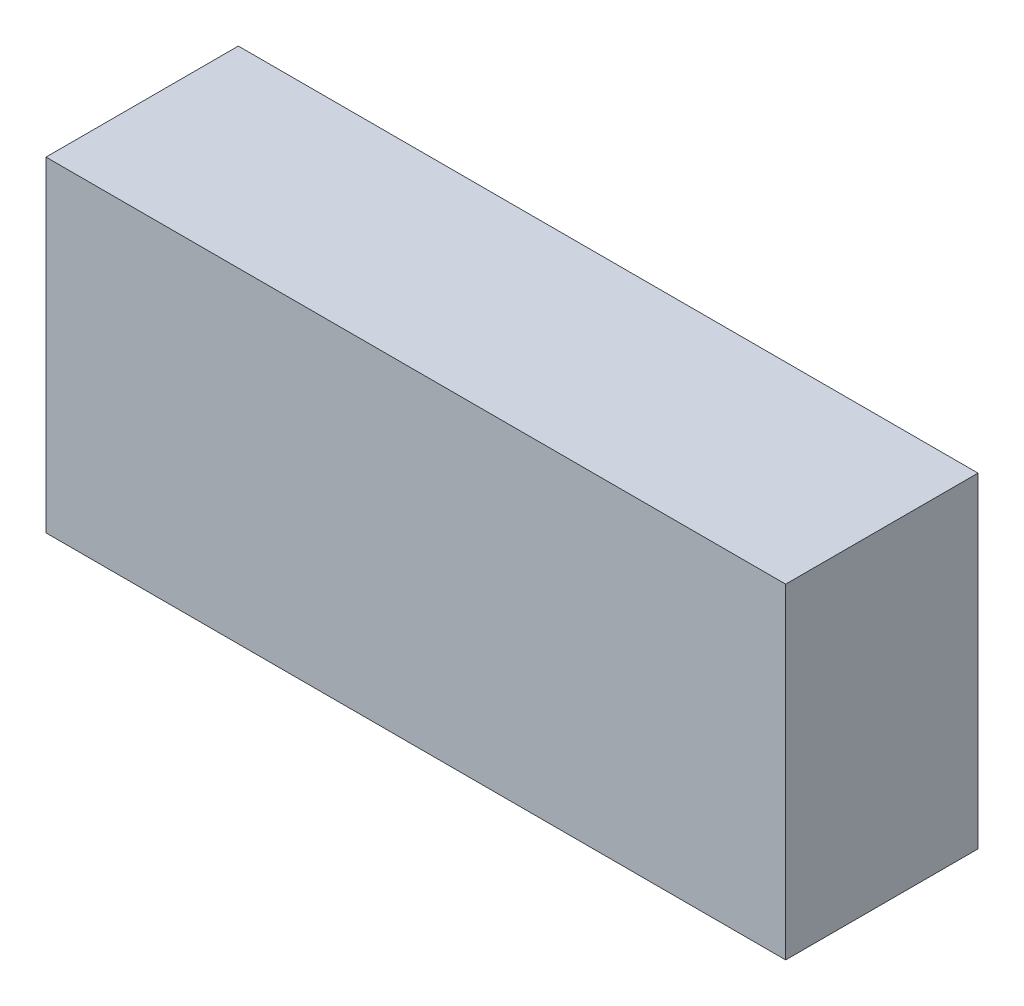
ISO-10303-21;
HEADER;
FILE_DESCRIPTION(('STEP AP214'),'2;1');
FILE_NAME('part.step','',(''),(''),'','','');
FILE_SCHEMA(('AUTOMOTIVE_DESIGN { 1 0 10303 214 1 1 1 1 }'));
ENDSEC;
DATA;
#1=APPLICATION_CONTEXT('core data for automotive mechanical design processes');
#2=APPLICATION_PROTOCOL_DEFINITION('international standard','automotive_design',2000,#1);
#3=PRODUCT_CONTEXT('',#1,'mechanical');
#4=PRODUCT('Part','Part','',(#3));
#5=PRODUCT_RELATED_PRODUCT_CATEGORY('part','',(#4));
#6=PRODUCT_DEFINITION_FORMATION('','',#4);
#7=PRODUCT_DEFINITION_CONTEXT('part definition',#1,'design');
#8=PRODUCT_DEFINITION('design','',#6,#7);
#9=PRODUCT_DEFINITION_SHAPE('','',#8);
#10=(LENGTH_UNIT() NAMED_UNIT(*) SI_UNIT(.MILLI.,.METRE.));
#11=(NAMED_UNIT(*) PLANE_ANGLE_UNIT() SI_UNIT($,.RADIAN.));
#12=(NAMED_UNIT(*) SI_UNIT($,.STERADIAN.) SOLID_ANGLE_UNIT());
#13=UNCERTAINTY_MEASURE_WITH_UNIT(LENGTH_MEASURE(1.E-05),#10,'distance_accuracy_value','');
#14=(GEOMETRIC_REPRESENTATION_CONTEXT(3) GLOBAL_UNCERTAINTY_ASSIGNED_CONTEXT((#13)) GLOBAL_UNIT_ASSIGNED_CONTEXT((#10,
#11,#12)) REPRESENTATION_CONTEXT('',''));
#15=CARTESIAN_POINT('',(0.,0.,0.));
#16=DIRECTION('',(0.,0.,1.));
#17=DIRECTION('',(1.,0.,0.));
#18=AXIS2_PLACEMENT_3D('',#15,#16,#17);
#19=CARTESIAN_POINT('',(-1.24999999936,0.54999999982,0.65000000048));
#20=DIRECTION('',(1.,0.,0.));
#21=DIRECTION('',(0.,0.,-1.));
#22=AXIS2_PLACEMENT_3D('',#19,#20,#21);
#23=PLANE('',#22);
#24=DIRECTION('',(0.,-1.,0.));
#25=VECTOR('',#24,1.);
#26=CARTESIAN_POINT('',(-1.24999999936,0.54999999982,0.));
#27=LINE('',#26,#25);
#28=CARTESIAN_POINT('',(-1.24999999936,0.54999999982,0.));
#29=VERTEX_POINT('',#28);
#30=CARTESIAN_POINT('',(-1.24999999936,-0.54999999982,0.));
#31=VERTEX_POINT('',#30);
#32=EDGE_CURVE('E96',#29,#31,#27,.T.);
#33=ORIENTED_EDGE('',*,*,#32,.T.);
#34=DIRECTION('',(0.,0.,-1.));
#35=VECTOR('',#34,1.);
#36=CARTESIAN_POINT('',(-1.24999999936,-0.54999999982,0.65000000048));
#37=LINE('',#36,#35);
#38=CARTESIAN_POINT('',(-1.24999999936,-0.54999999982,0.65000000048));
#39=VERTEX_POINT('',#38);
#40=EDGE_CURVE('E11',#39,#31,#37,.T.);
#41=ORIENTED_EDGE('',*,*,#40,.F.);
#42=DIRECTION('',(0.,-1.,0.));
#43=VECTOR('',#42,1.);
#44=CARTESIAN_POINT('',(-1.24999999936,0.54999999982,0.65000000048));
#45=LINE('',#44,#43);
#46=CARTESIAN_POINT('',(-1.24999999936,0.54999999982,0.65000000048));
#47=VERTEX_POINT('',#46);
#48=EDGE_CURVE('E84',#47,#39,#45,.T.);
#49=ORIENTED_EDGE('',*,*,#48,.F.);
#50=DIRECTION('',(0.,0.,-1.));
#51=VECTOR('',#50,1.);
#52=CARTESIAN_POINT('',(-1.24999999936,0.54999999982,0.65000000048));
#53=LINE('',#52,#51);
#54=EDGE_CURVE('E92',#47,#29,#53,.T.);
#55=ORIENTED_EDGE('',*,*,#54,.T.);
#56=EDGE_LOOP('',(#33,#41,#49,#55));
#57=FACE_BOUND('',#56,.T.);
#58=ADVANCED_FACE('F33',(#57),#23,.F.);
#59=CARTESIAN_POINT('',(-1.24999999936,-0.54999999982,0.65000000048));
#60=DIRECTION('',(0.,1.,0.));
#61=DIRECTION('',(0.,0.,1.));
#62=AXIS2_PLACEMENT_3D('',#59,#60,#61);
#63=PLANE('',#62);
#64=DIRECTION('',(1.,0.,0.));
#65=VECTOR('',#64,1.);
#66=CARTESIAN_POINT('',(-1.24999999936,-0.54999999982,0.));
#67=LINE('',#66,#65);
#68=CARTESIAN_POINT('',(1.24999999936,-0.54999999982,0.));
#69=VERTEX_POINT('',#68);
#70=EDGE_CURVE('E88',#31,#69,#67,.T.);
#71=ORIENTED_EDGE('',*,*,#70,.T.);
#72=DIRECTION('',(0.,0.,-1.));
#73=VECTOR('',#72,1.);
#74=CARTESIAN_POINT('',(1.24999999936,-0.54999999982,0.65000000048));
#75=LINE('',#74,#73);
#76=CARTESIAN_POINT('',(1.24999999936,-0.54999999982,0.65000000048));
#77=VERTEX_POINT('',#76);
#78=EDGE_CURVE('E41',#77,#69,#75,.T.);
#79=ORIENTED_EDGE('',*,*,#78,.F.);
#80=DIRECTION('',(1.,0.,0.));
#81=VECTOR('',#80,1.);
#82=CARTESIAN_POINT('',(-1.24999999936,-0.54999999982,0.65000000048));
#83=LINE('',#82,#81);
#84=EDGE_CURVE('E79',#39,#77,#83,.T.);
#85=ORIENTED_EDGE('',*,*,#84,.F.);
#86=ORIENTED_EDGE('',*,*,#40,.T.);
#87=EDGE_LOOP('',(#71,#79,#85,#86));
#88=FACE_BOUND('',#87,.T.);
#89=ADVANCED_FACE('F87',(#88),#63,.F.);
#90=CARTESIAN_POINT('',(1.24999999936,-0.54999999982,0.65000000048));
#91=DIRECTION('',(-1.,0.,0.));
#92=DIRECTION('',(0.,0.,1.));
#93=AXIS2_PLACEMENT_3D('',#90,#91,#92);
#94=PLANE('',#93);
#95=DIRECTION('',(0.,1.,0.));
#96=VECTOR('',#95,1.);
#97=CARTESIAN_POINT('',(1.24999999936,-0.54999999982,0.));
#98=LINE('',#97,#96);
#99=CARTESIAN_POINT('',(1.24999999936,0.54999999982,0.));
#100=VERTEX_POINT('',#99);
#101=EDGE_CURVE('E66',#69,#100,#98,.T.);
#102=ORIENTED_EDGE('',*,*,#101,.T.);
#103=DIRECTION('',(0.,0.,-1.));
#104=VECTOR('',#103,1.);
#105=CARTESIAN_POINT('',(1.24999999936,0.54999999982,0.65000000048));
#106=LINE('',#105,#104);
#107=CARTESIAN_POINT('',(1.24999999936,0.54999999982,0.65000000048));
#108=VERTEX_POINT('',#107);
#109=EDGE_CURVE('E89',#108,#100,#106,.T.);
#110=ORIENTED_EDGE('',*,*,#109,.F.);
#111=DIRECTION('',(0.,1.,0.));
#112=VECTOR('',#111,1.);
#113=CARTESIAN_POINT('',(1.24999999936,-0.54999999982,0.65000000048));
#114=LINE('',#113,#112);
#115=EDGE_CURVE('E82',#77,#108,#114,.T.);
#116=ORIENTED_EDGE('',*,*,#115,.F.);
#117=ORIENTED_EDGE('',*,*,#78,.T.);
#118=EDGE_LOOP('',(#102,#110,#116,#117));
#119=FACE_BOUND('',#118,.T.);
#120=ADVANCED_FACE('F90',(#119),#94,.F.);
#121=CARTESIAN_POINT('',(1.24999999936,0.54999999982,0.65000000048));
#122=DIRECTION('',(0.,-1.,0.));
#123=DIRECTION('',(0.,0.,-1.));
#124=AXIS2_PLACEMENT_3D('',#121,#122,#123);
#125=PLANE('',#124);
#126=DIRECTION('',(-1.,0.,0.));
#127=VECTOR('',#126,1.);
#128=CARTESIAN_POINT('',(1.24999999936,0.54999999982,0.));
#129=LINE('',#128,#127);
#130=EDGE_CURVE('E72',#100,#29,#129,.T.);
#131=ORIENTED_EDGE('',*,*,#130,.T.);
#132=ORIENTED_EDGE('',*,*,#54,.F.);
#133=DIRECTION('',(-1.,0.,0.));
#134=VECTOR('',#133,1.);
#135=CARTESIAN_POINT('',(1.24999999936,0.54999999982,0.65000000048));
#136=LINE('',#135,#134);
#137=EDGE_CURVE('E49',#108,#47,#136,.T.);
#138=ORIENTED_EDGE('',*,*,#137,.F.);
#139=ORIENTED_EDGE('',*,*,#109,.T.);
#140=EDGE_LOOP('',(#131,#132,#138,#139));
#141=FACE_BOUND('',#140,.T.);
#142=ADVANCED_FACE('F103',(#141),#125,.F.);
#143=CARTESIAN_POINT('',(0.,0.,0.65000000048));
#144=DIRECTION('',(0.,0.,1.));
#145=DIRECTION('',(1.,0.,0.));
#146=AXIS2_PLACEMENT_3D('',#143,#144,#145);
#147=PLANE('',#146);
#148=ORIENTED_EDGE('',*,*,#48,.T.);
#149=ORIENTED_EDGE('',*,*,#84,.T.);
#150=ORIENTED_EDGE('',*,*,#115,.T.);
#151=ORIENTED_EDGE('',*,*,#137,.T.);
#152=EDGE_LOOP('',(#148,#149,#150,#151));
#153=FACE_BOUND('',#152,.T.);
#154=ADVANCED_FACE('F80',(#153),#147,.T.);
#155=CARTESIAN_POINT('',(0.,0.,0.));
#156=DIRECTION('',(0.,0.,1.));
#157=DIRECTION('',(1.,0.,0.));
#158=AXIS2_PLACEMENT_3D('',#155,#156,#157);
#159=PLANE('',#158);
#160=ORIENTED_EDGE('',*,*,#32,.F.);
#161=ORIENTED_EDGE('',*,*,#130,.F.);
#162=ORIENTED_EDGE('',*,*,#101,.F.);
#163=ORIENTED_EDGE('',*,*,#70,.F.);
#164=EDGE_LOOP('',(#160,#161,#162,#163));
#165=FACE_BOUND('',#164,.T.);
#166=ADVANCED_FACE('F106',(#165),#159,.F.);
#167=CLOSED_SHELL('',(#58,#89,#120,#142,#154,#166));
#168=MANIFOLD_SOLID_BREP('B2',#167);
#169=ADVANCED_BREP_SHAPE_REPRESENTATION('',(#18,#168),#14);
#170=SHAPE_DEFINITION_REPRESENTATION(#9,#169);
ENDSEC;
END-ISO-10303-21;
